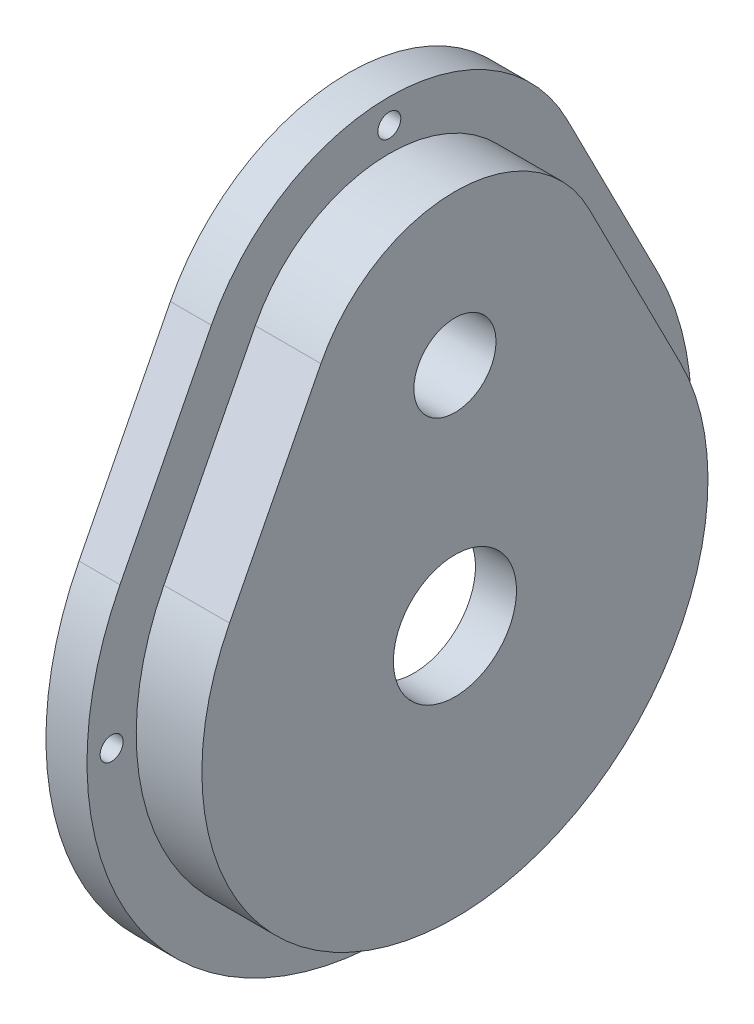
from build123d import *

# Parameters (mm, degrees)
BOSS_EXTRUDE2_DEPTH = 3.175
BOSS_EXTRUDE4_START = -5.08
BOSS_EXTRUDE4_DEPTH = 5.08
SKETCH3_R           = 4.7625
SKETCH3_R_2         = 3.175
CUT_EXTRUDE1_DEPTH  = 36.443531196
SKETCH4_R           = 0.889
BOSS_EXTRUDE6_DEPTH = 3.175
BOSS_EXTRUDE7_START = 1.524
SKETCH5_R           = 3.556
SKETCH5_R_2         = 3.175
BOSS_EXTRUDE7_DEPTH = 1.524


with BuildPart() as part:
    # Sketch1 → Boss-Extrude2 (new body)
    with BuildSketch(Plane.YZ):
        with BuildLine():
            Line((8.899813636, -17.440001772), (22.754359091, -10.369883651))
            ThreePointArc((22.754359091, -10.369883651), (29.10459, 0), (22.754359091, 10.369883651))
            Line((22.754359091, 10.369883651), (8.899813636, 17.440001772))
            ThreePointArc((8.899813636, 17.440001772), (-19.57959, 0), (8.899813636, -17.440001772))
        make_face()
    extrude(amount=BOSS_EXTRUDE2_DEPTH)

    # Sketch1_9 → Boss-Extrude4 (add)
    with BuildSketch(Plane.YZ.offset(BOSS_EXTRUDE4_START)):
        with BuildLine():
            Line((8.899813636, -17.440001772), (22.754359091, -10.369883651))
            ThreePointArc((22.754359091, -10.369883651), (29.10459, 0), (22.754359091, 10.369883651))
            Line((22.754359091, 10.369883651), (8.899813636, 17.440001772))
            ThreePointArc((8.899813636, 17.440001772), (-19.57959, 0), (8.899813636, -17.440001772))
        make_face()
        with BuildLine():
            Line((7.456631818, 14.611954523), (21.311177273, 7.541836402))
            ThreePointArc((21.311177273, 7.541836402), (25.92959, 0), (21.311177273, -7.541836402))
            Line((21.311177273, -7.541836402), (7.456631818, -14.611954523))
            ThreePointArc((7.456631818, -14.611954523), (-16.40459, 0), (7.456631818, 14.611954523))
        make_face(mode=Mode.SUBTRACT)
    extrude(amount=BOSS_EXTRUDE4_DEPTH)

    # Sketch3 → Cut-Extrude1 (cut, through all)
    with BuildSketch(Plane(origin=(0, 0, 0), x_dir=(0, -1, 0), z_dir=(-1, 0, 0))):
        with Locations(Location((0, 0, 0), (0, 0, 90))):
            Circle(SKETCH3_R)
        with Locations(Location((-17.4625, 0, 0), (0, 0, 90))):
            Circle(SKETCH3_R_2)
    extrude(amount=-CUT_EXTRUDE1_DEPTH, mode=Mode.SUBTRACT)

    # Sketch4 → Boss-Extrude6 (add)
    with BuildSketch(Plane(origin=(-5.08, 0, 0), x_dir=(0, -1, 0), z_dir=(-1, 0, 0))):
        with BuildLine():
            Line((-24.486177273, -13.763540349), (-10.631631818, -20.83365847))
            ThreePointArc((-10.631631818, -20.83365847), (23.38959, 0), (-10.631631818, 20.83365847))
            Line((-10.631631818, 20.83365847), (-24.486177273, 13.763540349))
            ThreePointArc((-24.486177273, 13.763540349), (-32.91459, 0), (-24.486177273, -13.763540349))
        make_face()
        with Locations(Location((0, -21.48459, 0), (0, 0, 90))):
            Circle(SKETCH4_R, mode=Mode.SUBTRACT)
        with Locations(Location((-31.00959, 0, 0), (0, 0, 90))):
            Circle(SKETCH4_R, mode=Mode.SUBTRACT)
        with Locations(Location((21.48459, 0, 0), (0, 0, 90))):
            Circle(SKETCH4_R, mode=Mode.SUBTRACT)
        with Locations(Location((0, 21.48459, 0), (0, 0, 90))):
            Circle(SKETCH4_R, mode=Mode.SUBTRACT)
        with BuildLine():
            Line((-8.899813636, -17.440001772), (-22.754359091, -10.369883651))
            ThreePointArc((-22.754359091, -10.369883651), (-29.10459, 0), (-22.754359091, 10.369883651))
            Line((-22.754359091, 10.369883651), (-8.899813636, 17.440001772))
            ThreePointArc((-8.899813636, 17.440001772), (19.57959, 0), (-8.899813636, -17.440001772))
        make_face(mode=Mode.SUBTRACT)
    extrude(amount=-BOSS_EXTRUDE6_DEPTH)

    # Sketch5 → Boss-Extrude7 (add)
    with BuildSketch(Plane(origin=(0, 0, 0), x_dir=(0, -1, 0), z_dir=(-1, 0, 0)).offset(BOSS_EXTRUDE7_START)):
        with Locations(Location((-17.4625, 0, 0), (0, 0, 270))):
            Circle(SKETCH5_R)
        with Locations(Location((-17.4625, 0, 0), (0, 0, 90))):
            Circle(SKETCH5_R_2, mode=Mode.SUBTRACT)
    extrude(amount=-BOSS_EXTRUDE7_DEPTH)


solid = part.part
